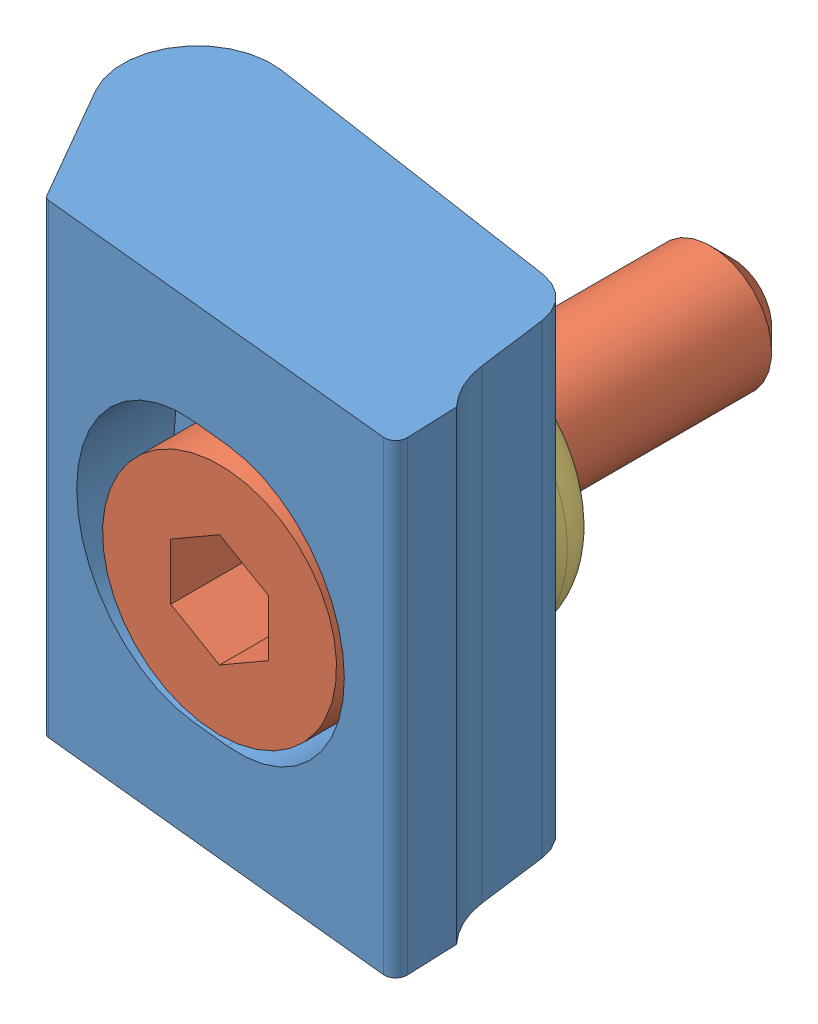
SolidWorks assembly MBSC025TC.sldasm, configuration Default (file format 15000). Lengths in mm.
Overall size (9.54 9.53 10.71).
3 component instances, 3 part files, 0 mates.
Components (placement in the parent):
- MBSC025TC_01-1: MBSC025TC_01.SLDPRT [ﾃﾞﾌｫﾙﾄ] at origin size (9.54 9.53 5.48)
- MBSC025TC_02-1: MBSC025TC_02.SLDPRT [ﾃﾞﾌｫﾙﾄ] at (0 0 2.7762) size (4.79 4.79 10.5)
- MBSC025TC_03-1: MBSC025TC_03.SLDPRT [ﾃﾞﾌｫﾙﾄ] at origin size (5.33 5.33 1.65)
